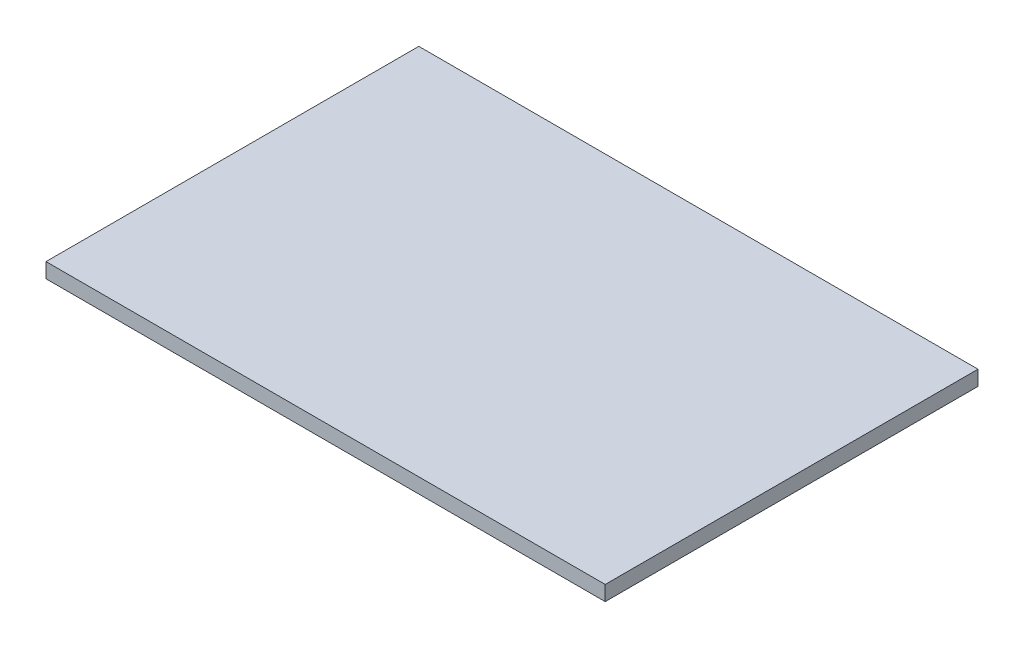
ISO-10303-21;
HEADER;
FILE_DESCRIPTION(('STEP AP214'),'2;1');
FILE_NAME('part.step','',(''),(''),'','','');
FILE_SCHEMA(('AUTOMOTIVE_DESIGN { 1 0 10303 214 1 1 1 1 }'));
ENDSEC;
DATA;
#1=APPLICATION_CONTEXT('core data for automotive mechanical design processes');
#2=APPLICATION_PROTOCOL_DEFINITION('international standard','automotive_design',2000,#1);
#3=PRODUCT_CONTEXT('',#1,'mechanical');
#4=PRODUCT('Part','Part','',(#3));
#5=PRODUCT_RELATED_PRODUCT_CATEGORY('part','',(#4));
#6=PRODUCT_DEFINITION_FORMATION('','',#4);
#7=PRODUCT_DEFINITION_CONTEXT('part definition',#1,'design');
#8=PRODUCT_DEFINITION('design','',#6,#7);
#9=PRODUCT_DEFINITION_SHAPE('','',#8);
#10=(LENGTH_UNIT() NAMED_UNIT(*) SI_UNIT(.MILLI.,.METRE.));
#11=(NAMED_UNIT(*) PLANE_ANGLE_UNIT() SI_UNIT($,.RADIAN.));
#12=(NAMED_UNIT(*) SI_UNIT($,.STERADIAN.) SOLID_ANGLE_UNIT());
#13=UNCERTAINTY_MEASURE_WITH_UNIT(LENGTH_MEASURE(1.E-05),#10,'distance_accuracy_value','');
#14=(GEOMETRIC_REPRESENTATION_CONTEXT(3) GLOBAL_UNCERTAINTY_ASSIGNED_CONTEXT((#13)) GLOBAL_UNIT_ASSIGNED_CONTEXT((#10,
#11,#12)) REPRESENTATION_CONTEXT('',''));
#15=CARTESIAN_POINT('',(0.,0.,0.));
#16=DIRECTION('',(0.,0.,1.));
#17=DIRECTION('',(1.,0.,0.));
#18=AXIS2_PLACEMENT_3D('',#15,#16,#17);
#19=CARTESIAN_POINT('',(0.,16.,0.));
#20=DIRECTION('',(1.,0.,0.));
#21=DIRECTION('',(0.,0.,-1.));
#22=AXIS2_PLACEMENT_3D('',#19,#20,#21);
#23=PLANE('',#22);
#24=DIRECTION('',(0.,0.,1.));
#25=VECTOR('',#24,1.);
#26=CARTESIAN_POINT('',(0.,0.,0.));
#27=LINE('',#26,#25);
#28=CARTESIAN_POINT('',(0.,0.,-400.));
#29=VERTEX_POINT('',#28);
#30=CARTESIAN_POINT('',(0.,0.,0.));
#31=VERTEX_POINT('',#30);
#32=EDGE_CURVE('E70',#29,#31,#27,.T.);
#33=ORIENTED_EDGE('',*,*,#32,.T.);
#34=DIRECTION('',(0.,-1.,0.));
#35=VECTOR('',#34,1.);
#36=CARTESIAN_POINT('',(0.,16.,0.));
#37=LINE('',#36,#35);
#38=CARTESIAN_POINT('',(0.,16.,0.));
#39=VERTEX_POINT('',#38);
#40=EDGE_CURVE('E11',#39,#31,#37,.T.);
#41=ORIENTED_EDGE('',*,*,#40,.F.);
#42=DIRECTION('',(0.,0.,1.));
#43=VECTOR('',#42,1.);
#44=CARTESIAN_POINT('',(0.,16.,0.));
#45=LINE('',#44,#43);
#46=CARTESIAN_POINT('',(0.,16.,-400.));
#47=VERTEX_POINT('',#46);
#48=EDGE_CURVE('E88',#47,#39,#45,.T.);
#49=ORIENTED_EDGE('',*,*,#48,.F.);
#50=DIRECTION('',(0.,-1.,0.));
#51=VECTOR('',#50,1.);
#52=CARTESIAN_POINT('',(0.,16.,-400.));
#53=LINE('',#52,#51);
#54=EDGE_CURVE('E82',#47,#29,#53,.T.);
#55=ORIENTED_EDGE('',*,*,#54,.T.);
#56=EDGE_LOOP('',(#33,#41,#49,#55));
#57=FACE_BOUND('',#56,.T.);
#58=ADVANCED_FACE('F26',(#57),#23,.F.);
#59=CARTESIAN_POINT('',(0.,16.,0.));
#60=DIRECTION('',(0.,0.,-1.));
#61=DIRECTION('',(-1.,0.,0.));
#62=AXIS2_PLACEMENT_3D('',#59,#60,#61);
#63=PLANE('',#62);
#64=DIRECTION('',(1.,0.,0.));
#65=VECTOR('',#64,1.);
#66=CARTESIAN_POINT('',(0.,0.,0.));
#67=LINE('',#66,#65);
#68=CARTESIAN_POINT('',(600.,0.,0.));
#69=VERTEX_POINT('',#68);
#70=EDGE_CURVE('E66',#31,#69,#67,.T.);
#71=ORIENTED_EDGE('',*,*,#70,.T.);
#72=DIRECTION('',(0.,-1.,0.));
#73=VECTOR('',#72,1.);
#74=CARTESIAN_POINT('',(600.,16.,0.));
#75=LINE('',#74,#73);
#76=CARTESIAN_POINT('',(600.,16.,0.));
#77=VERTEX_POINT('',#76);
#78=EDGE_CURVE('E33',#77,#69,#75,.T.);
#79=ORIENTED_EDGE('',*,*,#78,.F.);
#80=DIRECTION('',(1.,0.,0.));
#81=VECTOR('',#80,1.);
#82=CARTESIAN_POINT('',(0.,16.,0.));
#83=LINE('',#82,#81);
#84=EDGE_CURVE('E78',#39,#77,#83,.T.);
#85=ORIENTED_EDGE('',*,*,#84,.F.);
#86=ORIENTED_EDGE('',*,*,#40,.T.);
#87=EDGE_LOOP('',(#71,#79,#85,#86));
#88=FACE_BOUND('',#87,.T.);
#89=ADVANCED_FACE('F77',(#88),#63,.F.);
#90=CARTESIAN_POINT('',(600.,16.,0.));
#91=DIRECTION('',(-1.,0.,0.));
#92=DIRECTION('',(0.,0.,1.));
#93=AXIS2_PLACEMENT_3D('',#90,#91,#92);
#94=PLANE('',#93);
#95=DIRECTION('',(0.,0.,-1.));
#96=VECTOR('',#95,1.);
#97=CARTESIAN_POINT('',(600.,0.,0.));
#98=LINE('',#97,#96);
#99=CARTESIAN_POINT('',(600.,0.,-400.));
#100=VERTEX_POINT('',#99);
#101=EDGE_CURVE('E71',#69,#100,#98,.T.);
#102=ORIENTED_EDGE('',*,*,#101,.T.);
#103=DIRECTION('',(0.,-1.,0.));
#104=VECTOR('',#103,1.);
#105=CARTESIAN_POINT('',(600.,16.,-400.));
#106=LINE('',#105,#104);
#107=CARTESIAN_POINT('',(600.,16.,-400.));
#108=VERTEX_POINT('',#107);
#109=EDGE_CURVE('E94',#108,#100,#106,.T.);
#110=ORIENTED_EDGE('',*,*,#109,.F.);
#111=DIRECTION('',(0.,0.,-1.));
#112=VECTOR('',#111,1.);
#113=CARTESIAN_POINT('',(600.,16.,0.));
#114=LINE('',#113,#112);
#115=EDGE_CURVE('E45',#77,#108,#114,.T.);
#116=ORIENTED_EDGE('',*,*,#115,.F.);
#117=ORIENTED_EDGE('',*,*,#78,.T.);
#118=EDGE_LOOP('',(#102,#110,#116,#117));
#119=FACE_BOUND('',#118,.T.);
#120=ADVANCED_FACE('F97',(#119),#94,.F.);
#121=CARTESIAN_POINT('',(0.,16.,-400.));
#122=DIRECTION('',(0.,0.,1.));
#123=DIRECTION('',(1.,0.,0.));
#124=AXIS2_PLACEMENT_3D('',#121,#122,#123);
#125=PLANE('',#124);
#126=DIRECTION('',(-1.,0.,0.));
#127=VECTOR('',#126,1.);
#128=CARTESIAN_POINT('',(0.,0.,-400.));
#129=LINE('',#128,#127);
#130=EDGE_CURVE('E86',#100,#29,#129,.T.);
#131=ORIENTED_EDGE('',*,*,#130,.T.);
#132=ORIENTED_EDGE('',*,*,#54,.F.);
#133=DIRECTION('',(-1.,0.,0.));
#134=VECTOR('',#133,1.);
#135=CARTESIAN_POINT('',(0.,16.,-400.));
#136=LINE('',#135,#134);
#137=EDGE_CURVE('E40',#108,#47,#136,.T.);
#138=ORIENTED_EDGE('',*,*,#137,.F.);
#139=ORIENTED_EDGE('',*,*,#109,.T.);
#140=EDGE_LOOP('',(#131,#132,#138,#139));
#141=FACE_BOUND('',#140,.T.);
#142=ADVANCED_FACE('F99',(#141),#125,.F.);
#143=CARTESIAN_POINT('',(0.,16.,-400.));
#144=DIRECTION('',(0.,-1.,0.));
#145=DIRECTION('',(0.,0.,-1.));
#146=AXIS2_PLACEMENT_3D('',#143,#144,#145);
#147=PLANE('',#146);
#148=ORIENTED_EDGE('',*,*,#48,.T.);
#149=ORIENTED_EDGE('',*,*,#84,.T.);
#150=ORIENTED_EDGE('',*,*,#115,.T.);
#151=ORIENTED_EDGE('',*,*,#137,.T.);
#152=EDGE_LOOP('',(#148,#149,#150,#151));
#153=FACE_BOUND('',#152,.T.);
#154=ADVANCED_FACE('F100',(#153),#147,.F.);
#155=CARTESIAN_POINT('',(0.,0.,-400.));
#156=DIRECTION('',(0.,-1.,0.));
#157=DIRECTION('',(0.,0.,-1.));
#158=AXIS2_PLACEMENT_3D('',#155,#156,#157);
#159=PLANE('',#158);
#160=ORIENTED_EDGE('',*,*,#32,.F.);
#161=ORIENTED_EDGE('',*,*,#130,.F.);
#162=ORIENTED_EDGE('',*,*,#101,.F.);
#163=ORIENTED_EDGE('',*,*,#70,.F.);
#164=EDGE_LOOP('',(#160,#161,#162,#163));
#165=FACE_BOUND('',#164,.T.);
#166=ADVANCED_FACE('F67',(#165),#159,.T.);
#167=CLOSED_SHELL('',(#58,#89,#120,#142,#154,#166));
#168=MANIFOLD_SOLID_BREP('B2',#167);
#169=ADVANCED_BREP_SHAPE_REPRESENTATION('',(#18,#168),#14);
#170=SHAPE_DEFINITION_REPRESENTATION(#9,#169);
ENDSEC;
END-ISO-10303-21;
